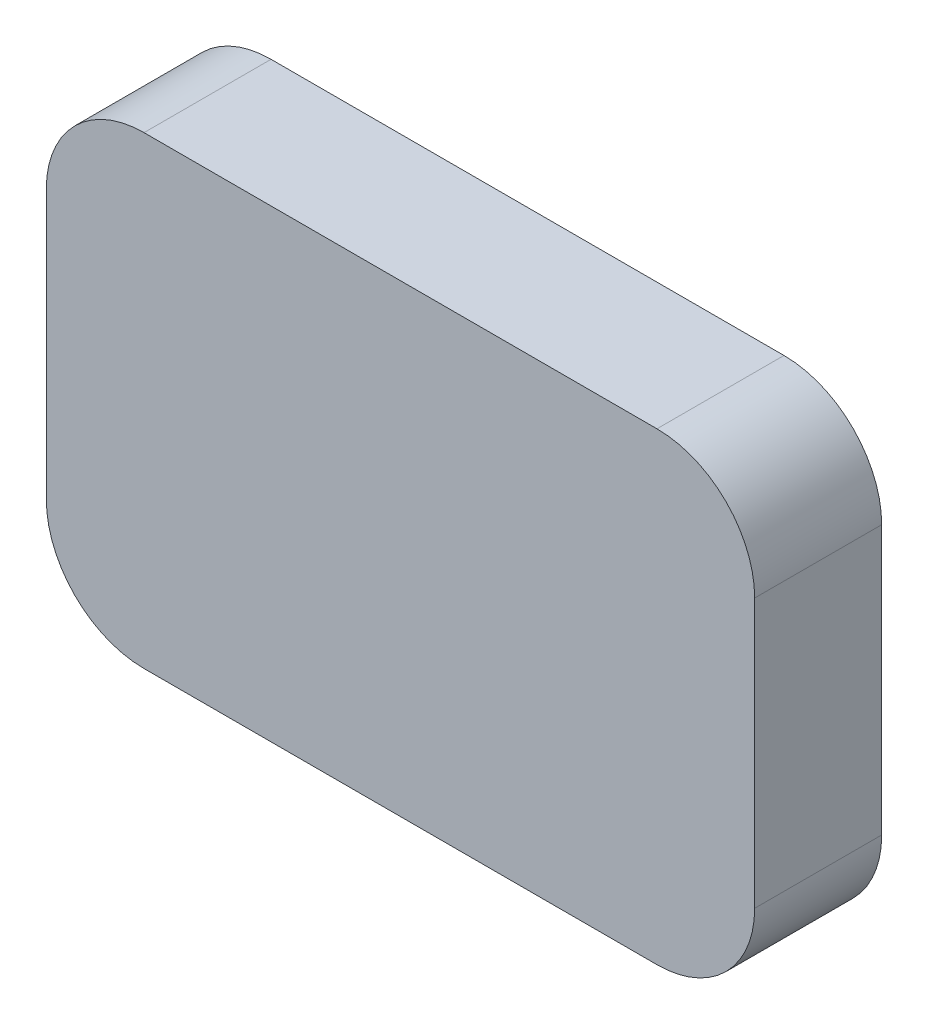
from build123d import *

# Parameters (mm, degrees)
EXTRUSION1_DEPTH = 26


with BuildPart() as part:
    # Esquisse1 → Extrusion1 (new body)
    with BuildSketch(Plane.XY):
        with BuildLine():
            Line((20, 0), (125, 0))
            ThreePointArc((125, 0), (139.142135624, 5.857864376), (145, 20))
            Line((145, 20), (145, 75))
            ThreePointArc((145, 75), (139.142135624, 89.142135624), (125, 95))
            Line((125, 95), (20, 95))
            ThreePointArc((20, 95), (5.857864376, 89.142135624), (0, 75))
            Line((0, 75), (0, 20))
            ThreePointArc((0, 20), (5.857864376, 5.857864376), (20, 0))
        make_face()
    extrude(amount=EXTRUSION1_DEPTH)


solid = part.part
